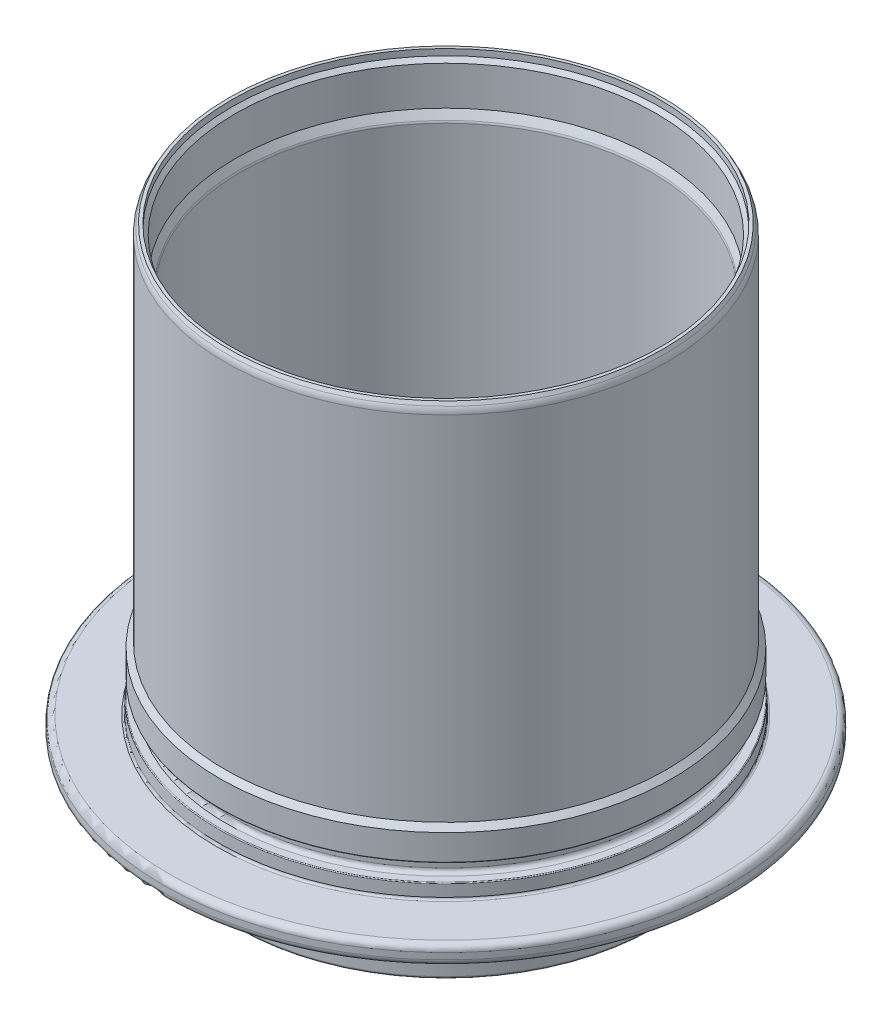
ISO-10303-21;
HEADER;
FILE_DESCRIPTION(('STEP AP214'),'2;1');
FILE_NAME('part.step','',(''),(''),'','','');
FILE_SCHEMA(('AUTOMOTIVE_DESIGN { 1 0 10303 214 1 1 1 1 }'));
ENDSEC;
DATA;
#1=APPLICATION_CONTEXT('core data for automotive mechanical design processes');
#2=APPLICATION_PROTOCOL_DEFINITION('international standard','automotive_design',2000,#1);
#3=PRODUCT_CONTEXT('',#1,'mechanical');
#4=PRODUCT('Part','Part','',(#3));
#5=PRODUCT_RELATED_PRODUCT_CATEGORY('part','',(#4));
#6=PRODUCT_DEFINITION_FORMATION('','',#4);
#7=PRODUCT_DEFINITION_CONTEXT('part definition',#1,'design');
#8=PRODUCT_DEFINITION('design','',#6,#7);
#9=PRODUCT_DEFINITION_SHAPE('','',#8);
#10=(LENGTH_UNIT() NAMED_UNIT(*) SI_UNIT(.MILLI.,.METRE.));
#11=(NAMED_UNIT(*) PLANE_ANGLE_UNIT() SI_UNIT($,.RADIAN.));
#12=(NAMED_UNIT(*) SI_UNIT($,.STERADIAN.) SOLID_ANGLE_UNIT());
#13=UNCERTAINTY_MEASURE_WITH_UNIT(LENGTH_MEASURE(1.E-05),#10,'distance_accuracy_value','');
#14=(GEOMETRIC_REPRESENTATION_CONTEXT(3) GLOBAL_UNCERTAINTY_ASSIGNED_CONTEXT((#13)) GLOBAL_UNIT_ASSIGNED_CONTEXT((#10,
#11,#12)) REPRESENTATION_CONTEXT('',''));
#15=CARTESIAN_POINT('',(0.,0.,0.));
#16=DIRECTION('',(0.,0.,1.));
#17=DIRECTION('',(1.,0.,0.));
#18=AXIS2_PLACEMENT_3D('',#15,#16,#17);
#19=CARTESIAN_POINT('',(-71.1716849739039,54.6294667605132,0.));
#20=DIRECTION('',(0.,1.,0.));
#21=DIRECTION('',(-1.,0.,0.));
#22=AXIS2_PLACEMENT_3D('',#19,#20,#21);
#23=TOROIDAL_SURFACE('',#22,37.0850000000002,11.9999999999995);
#24=CARTESIAN_POINT('',(-71.1716849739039,54.6294667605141,0.));
#25=DIRECTION('',(0.,1.,0.));
#26=DIRECTION('',(-1.,0.,0.));
#27=AXIS2_PLACEMENT_3D('',#24,#25,#26);
#28=CIRCLE('',#27,49.085);
#29=CARTESIAN_POINT('',(-120.256684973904,54.629466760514,0.));
#30=VERTEX_POINT('',#29);
#31=EDGE_CURVE('E189',#30,#30,#28,.T.);
#32=ORIENTED_EDGE('',*,*,#31,.T.);
#33=EDGE_LOOP('',(#32));
#34=FACE_BOUND('',#33,.T.);
#35=CARTESIAN_POINT('',(-71.1716849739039,46.1441853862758,0.));
#36=DIRECTION('',(0.,1.,0.));
#37=DIRECTION('',(-1.,0.,0.));
#38=AXIS2_PLACEMENT_3D('',#35,#36,#37);
#39=CIRCLE('',#38,45.5702813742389);
#40=CARTESIAN_POINT('',(-116.741966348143,46.1441853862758,0.));
#41=VERTEX_POINT('',#40);
#42=EDGE_CURVE('E10',#41,#41,#39,.T.);
#43=ORIENTED_EDGE('',*,*,#42,.F.);
#44=EDGE_LOOP('',(#43));
#45=FACE_BOUND('',#44,.T.);
#46=ADVANCED_FACE('F35',(#34,#45),#23,.F.);
#47=CARTESIAN_POINT('',(-71.1716849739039,40.4667972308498,0.));
#48=DIRECTION('',(0.,1.,0.));
#49=DIRECTION('',(-1.,0.,0.));
#50=AXIS2_PLACEMENT_3D('',#47,#48,#49);
#51=CONICAL_SURFACE('',#50,39.8928932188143,0.785398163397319);
#52=ORIENTED_EDGE('',*,*,#42,.T.);
#53=EDGE_LOOP('',(#52));
#54=FACE_BOUND('',#53,.T.);
#55=CARTESIAN_POINT('',(-71.1716849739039,40.4667972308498,0.));
#56=DIRECTION('',(0.,1.,0.));
#57=DIRECTION('',(-1.,0.,0.));
#58=AXIS2_PLACEMENT_3D('',#55,#56,#57);
#59=CIRCLE('',#58,39.8928932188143);
#60=CARTESIAN_POINT('',(-111.064578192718,40.4667972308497,0.));
#61=VERTEX_POINT('',#60);
#62=EDGE_CURVE('E41',#61,#61,#59,.T.);
#63=ORIENTED_EDGE('',*,*,#62,.F.);
#64=EDGE_LOOP('',(#63));
#65=FACE_BOUND('',#64,.T.);
#66=ADVANCED_FACE('F207',(#54,#65),#51,.F.);
#67=CARTESIAN_POINT('',(-71.1716849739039,39.7596904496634,0.));
#68=DIRECTION('',(0.,1.,0.));
#69=DIRECTION('',(-1.,0.,0.));
#70=AXIS2_PLACEMENT_3D('',#67,#68,#69);
#71=TOROIDAL_SURFACE('',#70,40.6000000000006,1.00000000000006);
#72=ORIENTED_EDGE('',*,*,#62,.T.);
#73=EDGE_LOOP('',(#72));
#74=FACE_BOUND('',#73,.T.);
#75=CARTESIAN_POINT('',(-71.1716849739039,39.7596904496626,0.));
#76=DIRECTION('',(0.,1.,0.));
#77=DIRECTION('',(-1.,0.,0.));
#78=AXIS2_PLACEMENT_3D('',#75,#76,#77);
#79=CIRCLE('',#78,39.6000000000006);
#80=CARTESIAN_POINT('',(-110.771684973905,39.7596904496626,0.));
#81=VERTEX_POINT('',#80);
#82=EDGE_CURVE('E45',#81,#81,#79,.T.);
#83=ORIENTED_EDGE('',*,*,#82,.F.);
#84=EDGE_LOOP('',(#83));
#85=FACE_BOUND('',#84,.T.);
#86=ADVANCED_FACE('F211',(#74,#85),#71,.T.);
#87=CARTESIAN_POINT('',(-71.1716849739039,158.736724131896,0.));
#88=DIRECTION('',(0.,1.,0.));
#89=DIRECTION('',(-1.,0.,0.));
#90=AXIS2_PLACEMENT_3D('',#87,#88,#89);
#91=CYLINDRICAL_SURFACE('',#90,39.6000000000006);
#92=ORIENTED_EDGE('',*,*,#82,.T.);
#93=EDGE_LOOP('',(#92));
#94=FACE_BOUND('',#93,.T.);
#95=CARTESIAN_POINT('',(-71.1716849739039,39.2739577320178,0.));
#96=DIRECTION('',(0.,1.,0.));
#97=DIRECTION('',(-1.,0.,0.));
#98=AXIS2_PLACEMENT_3D('',#95,#96,#97);
#99=CIRCLE('',#98,39.6000000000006);
#100=CARTESIAN_POINT('',(-110.771684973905,39.2739577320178,0.));
#101=VERTEX_POINT('',#100);
#102=EDGE_CURVE('E49',#101,#101,#99,.T.);
#103=ORIENTED_EDGE('',*,*,#102,.F.);
#104=EDGE_LOOP('',(#103));
#105=FACE_BOUND('',#104,.T.);
#106=ADVANCED_FACE('F215',(#94,#105),#91,.F.);
#107=CARTESIAN_POINT('',(-71.1716849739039,39.2739577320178,0.));
#108=DIRECTION('',(0.,1.,0.));
#109=DIRECTION('',(-1.,0.,0.));
#110=AXIS2_PLACEMENT_3D('',#107,#108,#109);
#111=TOROIDAL_SURFACE('',#110,40.0000000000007,0.400000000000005);
#112=ORIENTED_EDGE('',*,*,#102,.T.);
#113=EDGE_LOOP('',(#112));
#114=FACE_BOUND('',#113,.T.);
#115=CARTESIAN_POINT('',(-71.1716849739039,38.8739577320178,0.));
#116=DIRECTION('',(0.,1.,0.));
#117=DIRECTION('',(-1.,0.,0.));
#118=AXIS2_PLACEMENT_3D('',#115,#116,#117);
#119=CIRCLE('',#118,40.0000000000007);
#120=CARTESIAN_POINT('',(-111.171684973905,38.8739577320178,0.));
#121=VERTEX_POINT('',#120);
#122=EDGE_CURVE('E54',#121,#121,#119,.T.);
#123=ORIENTED_EDGE('',*,*,#122,.F.);
#124=EDGE_LOOP('',(#123));
#125=FACE_BOUND('',#124,.T.);
#126=ADVANCED_FACE('F221',(#114,#125),#111,.T.);
#127=CARTESIAN_POINT('',(-113.496714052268,38.8739577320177,0.));
#128=DIRECTION('',(0.,-1.,0.));
#129=DIRECTION('',(1.,0.,0.));
#130=AXIS2_PLACEMENT_3D('',#127,#128,#129);
#131=PLANE('',#130);
#132=ORIENTED_EDGE('',*,*,#122,.T.);
#133=EDGE_LOOP('',(#132));
#134=FACE_BOUND('',#133,.T.);
#135=CARTESIAN_POINT('',(-71.1716849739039,38.8739577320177,0.));
#136=DIRECTION('',(0.,1.,0.));
#137=DIRECTION('',(-1.,0.,0.));
#138=AXIS2_PLACEMENT_3D('',#135,#136,#137);
#139=CIRCLE('',#138,42.3250290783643);
#140=CARTESIAN_POINT('',(-113.496714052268,38.8739577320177,0.));
#141=VERTEX_POINT('',#140);
#142=EDGE_CURVE('E57',#141,#141,#139,.T.);
#143=ORIENTED_EDGE('',*,*,#142,.F.);
#144=EDGE_LOOP('',(#143));
#145=FACE_BOUND('',#144,.T.);
#146=ADVANCED_FACE('F225',(#134,#145),#131,.T.);
#147=CARTESIAN_POINT('',(-71.1716849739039,37.3739577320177,0.));
#148=DIRECTION('',(0.,1.,0.));
#149=DIRECTION('',(-1.,0.,0.));
#150=AXIS2_PLACEMENT_3D('',#147,#148,#149);
#151=TOROIDAL_SURFACE('',#150,42.3250290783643,1.5);
#152=ORIENTED_EDGE('',*,*,#142,.T.);
#153=EDGE_LOOP('',(#152));
#154=FACE_BOUND('',#153,.T.);
#155=CARTESIAN_POINT('',(-71.1716849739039,37.3739577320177,0.));
#156=DIRECTION('',(0.,1.,0.));
#157=DIRECTION('',(-1.,0.,0.));
#158=AXIS2_PLACEMENT_3D('',#155,#156,#157);
#159=CIRCLE('',#158,43.8250290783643);
#160=CARTESIAN_POINT('',(-114.996714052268,37.3739577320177,0.));
#161=VERTEX_POINT('',#160);
#162=EDGE_CURVE('E60',#161,#161,#159,.T.);
#163=ORIENTED_EDGE('',*,*,#162,.F.);
#164=EDGE_LOOP('',(#163));
#165=FACE_BOUND('',#164,.T.);
#166=ADVANCED_FACE('F229',(#154,#165),#151,.F.);
#167=CARTESIAN_POINT('',(-71.1716849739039,158.736724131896,0.));
#168=DIRECTION('',(0.,1.,0.));
#169=DIRECTION('',(-1.,0.,0.));
#170=AXIS2_PLACEMENT_3D('',#167,#168,#169);
#171=CYLINDRICAL_SURFACE('',#170,43.8250290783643);
#172=ORIENTED_EDGE('',*,*,#162,.T.);
#173=EDGE_LOOP('',(#172));
#174=FACE_BOUND('',#173,.T.);
#175=CARTESIAN_POINT('',(-71.1716849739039,34.3739577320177,0.));
#176=DIRECTION('',(0.,1.,0.));
#177=DIRECTION('',(-1.,0.,0.));
#178=AXIS2_PLACEMENT_3D('',#175,#176,#177);
#179=CIRCLE('',#178,43.8250290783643);
#180=CARTESIAN_POINT('',(-114.996714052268,34.3739577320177,0.));
#181=VERTEX_POINT('',#180);
#182=EDGE_CURVE('E63',#181,#181,#179,.T.);
#183=ORIENTED_EDGE('',*,*,#182,.F.);
#184=EDGE_LOOP('',(#183));
#185=FACE_BOUND('',#184,.T.);
#186=ADVANCED_FACE('F233',(#174,#185),#171,.F.);
#187=CARTESIAN_POINT('',(-71.1716849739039,34.3739577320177,0.));
#188=DIRECTION('',(0.,1.,0.));
#189=DIRECTION('',(-1.,0.,0.));
#190=AXIS2_PLACEMENT_3D('',#187,#188,#189);
#191=TOROIDAL_SURFACE('',#190,42.3250290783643,1.5);
#192=ORIENTED_EDGE('',*,*,#182,.T.);
#193=EDGE_LOOP('',(#192));
#194=FACE_BOUND('',#193,.T.);
#195=CARTESIAN_POINT('',(-71.1716849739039,32.8739577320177,0.));
#196=DIRECTION('',(0.,1.,0.));
#197=DIRECTION('',(-1.,0.,0.));
#198=AXIS2_PLACEMENT_3D('',#195,#196,#197);
#199=CIRCLE('',#198,42.3250290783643);
#200=CARTESIAN_POINT('',(-113.496714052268,32.8739577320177,0.));
#201=VERTEX_POINT('',#200);
#202=EDGE_CURVE('E66',#201,#201,#199,.T.);
#203=ORIENTED_EDGE('',*,*,#202,.F.);
#204=EDGE_LOOP('',(#203));
#205=FACE_BOUND('',#204,.T.);
#206=ADVANCED_FACE('F237',(#194,#205),#191,.F.);
#207=CARTESIAN_POINT('',(-113.496714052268,32.8739577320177,0.));
#208=DIRECTION('',(0.,1.,0.));
#209=DIRECTION('',(-1.,0.,0.));
#210=AXIS2_PLACEMENT_3D('',#207,#208,#209);
#211=PLANE('',#210);
#212=ORIENTED_EDGE('',*,*,#202,.T.);
#213=EDGE_LOOP('',(#212));
#214=FACE_BOUND('',#213,.T.);
#215=CARTESIAN_POINT('',(-71.1716849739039,32.8739577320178,0.));
#216=DIRECTION('',(0.,1.,0.));
#217=DIRECTION('',(-1.,0.,0.));
#218=AXIS2_PLACEMENT_3D('',#215,#216,#217);
#219=CIRCLE('',#218,39.3500000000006);
#220=CARTESIAN_POINT('',(-110.521684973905,32.8739577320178,0.));
#221=VERTEX_POINT('',#220);
#222=EDGE_CURVE('E69',#221,#221,#219,.T.);
#223=ORIENTED_EDGE('',*,*,#222,.F.);
#224=EDGE_LOOP('',(#223));
#225=FACE_BOUND('',#224,.T.);
#226=ADVANCED_FACE('F241',(#214,#225),#211,.T.);
#227=CARTESIAN_POINT('',(-71.1716849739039,32.4739577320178,0.));
#228=DIRECTION('',(0.,1.,0.));
#229=DIRECTION('',(-1.,0.,0.));
#230=AXIS2_PLACEMENT_3D('',#227,#228,#229);
#231=TOROIDAL_SURFACE('',#230,39.3500000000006,0.399999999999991);
#232=ORIENTED_EDGE('',*,*,#222,.T.);
#233=EDGE_LOOP('',(#232));
#234=FACE_BOUND('',#233,.T.);
#235=CARTESIAN_POINT('',(-71.1716849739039,32.4739577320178,0.));
#236=DIRECTION('',(0.,1.,0.));
#237=DIRECTION('',(-1.,0.,0.));
#238=AXIS2_PLACEMENT_3D('',#235,#236,#237);
#239=CIRCLE('',#238,38.9500000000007);
#240=CARTESIAN_POINT('',(-110.121684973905,32.4739577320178,0.));
#241=VERTEX_POINT('',#240);
#242=EDGE_CURVE('E72',#241,#241,#239,.T.);
#243=ORIENTED_EDGE('',*,*,#242,.F.);
#244=EDGE_LOOP('',(#243));
#245=FACE_BOUND('',#244,.T.);
#246=ADVANCED_FACE('F245',(#234,#245),#231,.T.);
#247=CARTESIAN_POINT('',(-71.1716849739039,158.736724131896,0.));
#248=DIRECTION('',(0.,1.,0.));
#249=DIRECTION('',(-1.,0.,0.));
#250=AXIS2_PLACEMENT_3D('',#247,#248,#249);
#251=CYLINDRICAL_SURFACE('',#250,38.9500000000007);
#252=ORIENTED_EDGE('',*,*,#242,.T.);
#253=EDGE_LOOP('',(#252));
#254=FACE_BOUND('',#253,.T.);
#255=CARTESIAN_POINT('',(-71.1716849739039,31.6419486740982,0.));
#256=DIRECTION('',(0.,1.,0.));
#257=DIRECTION('',(-1.,0.,0.));
#258=AXIS2_PLACEMENT_3D('',#255,#256,#257);
#259=CIRCLE('',#258,38.9500000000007);
#260=CARTESIAN_POINT('',(-110.121684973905,31.6419486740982,0.));
#261=VERTEX_POINT('',#260);
#262=EDGE_CURVE('E75',#261,#261,#259,.T.);
#263=ORIENTED_EDGE('',*,*,#262,.F.);
#264=EDGE_LOOP('',(#263));
#265=FACE_BOUND('',#264,.T.);
#266=ADVANCED_FACE('F249',(#254,#265),#251,.F.);
#267=CARTESIAN_POINT('',(-71.1716849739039,31.6419486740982,0.));
#268=DIRECTION('',(0.,1.,0.));
#269=DIRECTION('',(-1.,0.,0.));
#270=AXIS2_PLACEMENT_3D('',#267,#268,#269);
#271=TOROIDAL_SURFACE('',#270,39.9500000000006,1.00000000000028);
#272=ORIENTED_EDGE('',*,*,#262,.T.);
#273=EDGE_LOOP('',(#272));
#274=FACE_BOUND('',#273,.T.);
#275=CARTESIAN_POINT('',(-71.1716849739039,31.1419486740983,0.));
#276=DIRECTION('',(0.,1.,0.));
#277=DIRECTION('',(-1.,0.,0.));
#278=AXIS2_PLACEMENT_3D('',#275,#276,#277);
#279=CIRCLE('',#278,39.0839745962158);
#280=CARTESIAN_POINT('',(-110.25565957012,31.1419486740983,0.));
#281=VERTEX_POINT('',#280);
#282=EDGE_CURVE('E78',#281,#281,#279,.T.);
#283=ORIENTED_EDGE('',*,*,#282,.F.);
#284=EDGE_LOOP('',(#283));
#285=FACE_BOUND('',#284,.T.);
#286=ADVANCED_FACE('F253',(#274,#285),#271,.T.);
#287=CARTESIAN_POINT('',(-71.1716849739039,30.3739577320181,0.));
#288=DIRECTION('',(0.,-1.,0.));
#289=DIRECTION('',(1.,0.,0.));
#290=AXIS2_PLACEMENT_3D('',#287,#288,#289);
#291=CONICAL_SURFACE('',#290,39.5273743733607,0.523598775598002);
#292=ORIENTED_EDGE('',*,*,#282,.T.);
#293=EDGE_LOOP('',(#292));
#294=FACE_BOUND('',#293,.T.);
#295=CARTESIAN_POINT('',(-71.1716849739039,30.3739577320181,0.));
#296=DIRECTION('',(0.,1.,0.));
#297=DIRECTION('',(-1.,0.,0.));
#298=AXIS2_PLACEMENT_3D('',#295,#296,#297);
#299=CIRCLE('',#298,39.5273743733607);
#300=CARTESIAN_POINT('',(-110.699059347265,30.3739577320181,0.));
#301=VERTEX_POINT('',#300);
#302=EDGE_CURVE('E81',#301,#301,#299,.T.);
#303=ORIENTED_EDGE('',*,*,#302,.F.);
#304=EDGE_LOOP('',(#303));
#305=FACE_BOUND('',#304,.T.);
#306=ADVANCED_FACE('F257',(#294,#305),#291,.F.);
#307=CARTESIAN_POINT('',(-110.699059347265,30.3739577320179,0.));
#308=DIRECTION('',(0.,-1.,0.));
#309=DIRECTION('',(1.,0.,0.));
#310=AXIS2_PLACEMENT_3D('',#307,#308,#309);
#311=PLANE('',#310);
#312=ORIENTED_EDGE('',*,*,#302,.T.);
#313=EDGE_LOOP('',(#312));
#314=FACE_BOUND('',#313,.T.);
#315=CARTESIAN_POINT('',(-71.1716849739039,30.3739577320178,0.));
#316=DIRECTION('',(0.,1.,0.));
#317=DIRECTION('',(-1.,0.,0.));
#318=AXIS2_PLACEMENT_3D('',#315,#316,#317);
#319=CIRCLE('',#318,49.3000000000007);
#320=CARTESIAN_POINT('',(-120.471684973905,30.3739577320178,0.));
#321=VERTEX_POINT('',#320);
#322=EDGE_CURVE('E84',#321,#321,#319,.T.);
#323=ORIENTED_EDGE('',*,*,#322,.F.);
#324=EDGE_LOOP('',(#323));
#325=FACE_BOUND('',#324,.T.);
#326=ADVANCED_FACE('F261',(#314,#325),#311,.T.);
#327=CARTESIAN_POINT('',(-71.1716849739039,30.8739577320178,0.));
#328=DIRECTION('',(0.,1.,0.));
#329=DIRECTION('',(-1.,0.,0.));
#330=AXIS2_PLACEMENT_3D('',#327,#328,#329);
#331=TOROIDAL_SURFACE('',#330,49.3000000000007,0.500000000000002);
#332=ORIENTED_EDGE('',*,*,#322,.T.);
#333=EDGE_LOOP('',(#332));
#334=FACE_BOUND('',#333,.T.);
#335=CARTESIAN_POINT('',(-71.1716849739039,30.8739577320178,0.));
#336=DIRECTION('',(0.,1.,0.));
#337=DIRECTION('',(-1.,0.,0.));
#338=AXIS2_PLACEMENT_3D('',#335,#336,#337);
#339=CIRCLE('',#338,49.8000000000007);
#340=CARTESIAN_POINT('',(-120.971684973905,30.8739577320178,0.));
#341=VERTEX_POINT('',#340);
#342=EDGE_CURVE('E87',#341,#341,#339,.T.);
#343=ORIENTED_EDGE('',*,*,#342,.F.);
#344=EDGE_LOOP('',(#343));
#345=FACE_BOUND('',#344,.T.);
#346=ADVANCED_FACE('F265',(#334,#345),#331,.T.);
#347=CARTESIAN_POINT('',(-71.1716849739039,158.736724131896,0.));
#348=DIRECTION('',(0.,1.,0.));
#349=DIRECTION('',(-1.,0.,0.));
#350=AXIS2_PLACEMENT_3D('',#347,#348,#349);
#351=CYLINDRICAL_SURFACE('',#350,49.8000000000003);
#352=ORIENTED_EDGE('',*,*,#342,.T.);
#353=EDGE_LOOP('',(#352));
#354=FACE_BOUND('',#353,.T.);
#355=CARTESIAN_POINT('',(-71.1716849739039,34.5858430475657,0.));
#356=DIRECTION('',(0.,1.,0.));
#357=DIRECTION('',(-1.,0.,0.));
#358=AXIS2_PLACEMENT_3D('',#355,#356,#357);
#359=CIRCLE('',#358,49.8);
#360=CARTESIAN_POINT('',(-120.971684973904,34.5858430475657,0.));
#361=VERTEX_POINT('',#360);
#362=EDGE_CURVE('E90',#361,#361,#359,.T.);
#363=ORIENTED_EDGE('',*,*,#362,.F.);
#364=EDGE_LOOP('',(#363));
#365=FACE_BOUND('',#364,.T.);
#366=ADVANCED_FACE('F269',(#354,#365),#351,.T.);
#367=CARTESIAN_POINT('',(-71.1716849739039,34.5858430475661,0.));
#368=DIRECTION('',(0.,1.,0.));
#369=DIRECTION('',(-1.,0.,0.));
#370=AXIS2_PLACEMENT_3D('',#367,#368,#369);
#371=TOROIDAL_SURFACE('',#370,48.3000000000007,1.49999999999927);
#372=ORIENTED_EDGE('',*,*,#362,.T.);
#373=EDGE_LOOP('',(#372));
#374=FACE_BOUND('',#373,.T.);
#375=CARTESIAN_POINT('',(-71.1716849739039,35.3358430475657,0.));
#376=DIRECTION('',(0.,1.,0.));
#377=DIRECTION('',(-1.,0.,0.));
#378=AXIS2_PLACEMENT_3D('',#375,#376,#377);
#379=CIRCLE('',#378,49.5990381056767);
#380=CARTESIAN_POINT('',(-120.770723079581,35.3358430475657,0.));
#381=VERTEX_POINT('',#380);
#382=EDGE_CURVE('E93',#381,#381,#379,.T.);
#383=ORIENTED_EDGE('',*,*,#382,.F.);
#384=EDGE_LOOP('',(#383));
#385=FACE_BOUND('',#384,.T.);
#386=ADVANCED_FACE('F273',(#374,#385),#371,.T.);
#387=CARTESIAN_POINT('',(-71.1716849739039,37.93058715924,0.));
#388=DIRECTION('',(0.,-1.,0.));
#389=DIRECTION('',(1.,0.,0.));
#390=AXIS2_PLACEMENT_3D('',#387,#388,#389);
#391=CONICAL_SURFACE('',#390,48.1009618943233,0.523598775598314);
#392=ORIENTED_EDGE('',*,*,#382,.T.);
#393=EDGE_LOOP('',(#392));
#394=FACE_BOUND('',#393,.T.);
#395=CARTESIAN_POINT('',(-71.1716849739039,37.93058715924,0.));
#396=DIRECTION('',(0.,1.,0.));
#397=DIRECTION('',(-1.,0.,0.));
#398=AXIS2_PLACEMENT_3D('',#395,#396,#397);
#399=CIRCLE('',#398,48.1009618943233);
#400=CARTESIAN_POINT('',(-119.272646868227,37.93058715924,0.));
#401=VERTEX_POINT('',#400);
#402=EDGE_CURVE('E96',#401,#401,#399,.T.);
#403=ORIENTED_EDGE('',*,*,#402,.F.);
#404=EDGE_LOOP('',(#403));
#405=FACE_BOUND('',#404,.T.);
#406=ADVANCED_FACE('F277',(#394,#405),#391,.T.);
#407=CARTESIAN_POINT('',(-71.1716849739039,38.6805871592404,0.));
#408=DIRECTION('',(0.,1.,0.));
#409=DIRECTION('',(-1.,0.,0.));
#410=AXIS2_PLACEMENT_3D('',#407,#408,#409);
#411=TOROIDAL_SURFACE('',#410,49.4000000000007,1.50000000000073);
#412=ORIENTED_EDGE('',*,*,#402,.T.);
#413=EDGE_LOOP('',(#412));
#414=FACE_BOUND('',#413,.T.);
#415=CARTESIAN_POINT('',(-71.1716849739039,38.68058715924,0.));
#416=DIRECTION('',(0.,1.,0.));
#417=DIRECTION('',(-1.,0.,0.));
#418=AXIS2_PLACEMENT_3D('',#415,#416,#417);
#419=CIRCLE('',#418,47.8999999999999);
#420=CARTESIAN_POINT('',(-119.071684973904,38.6805871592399,0.));
#421=VERTEX_POINT('',#420);
#422=EDGE_CURVE('E99',#421,#421,#419,.T.);
#423=ORIENTED_EDGE('',*,*,#422,.F.);
#424=EDGE_LOOP('',(#423));
#425=FACE_BOUND('',#424,.T.);
#426=ADVANCED_FACE('F281',(#414,#425),#411,.F.);
#427=CARTESIAN_POINT('',(-71.1716849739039,158.736724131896,0.));
#428=DIRECTION('',(0.,1.,0.));
#429=DIRECTION('',(-1.,0.,0.));
#430=AXIS2_PLACEMENT_3D('',#427,#428,#429);
#431=CYLINDRICAL_SURFACE('',#430,47.9);
#432=ORIENTED_EDGE('',*,*,#422,.T.);
#433=EDGE_LOOP('',(#432));
#434=FACE_BOUND('',#433,.T.);
#435=CARTESIAN_POINT('',(-71.1716849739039,40.8767395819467,0.));
#436=DIRECTION('',(0.,1.,0.));
#437=DIRECTION('',(-1.,0.,0.));
#438=AXIS2_PLACEMENT_3D('',#435,#436,#437);
#439=CIRCLE('',#438,47.9000000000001);
#440=CARTESIAN_POINT('',(-119.071684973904,40.8767395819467,0.));
#441=VERTEX_POINT('',#440);
#442=EDGE_CURVE('E102',#441,#441,#439,.T.);
#443=ORIENTED_EDGE('',*,*,#442,.F.);
#444=EDGE_LOOP('',(#443));
#445=FACE_BOUND('',#444,.T.);
#446=ADVANCED_FACE('F285',(#434,#445),#431,.T.);
#447=CARTESIAN_POINT('',(-71.1716849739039,40.876739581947,0.));
#448=DIRECTION('',(0.,1.,0.));
#449=DIRECTION('',(-1.,0.,0.));
#450=AXIS2_PLACEMENT_3D('',#447,#448,#449);
#451=TOROIDAL_SURFACE('',#450,49.4000000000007,1.50000000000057);
#452=ORIENTED_EDGE('',*,*,#442,.T.);
#453=EDGE_LOOP('',(#452));
#454=FACE_BOUND('',#453,.T.);
#455=CARTESIAN_POINT('',(-71.1716849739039,41.626739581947,0.));
#456=DIRECTION('',(0.,1.,0.));
#457=DIRECTION('',(-1.,0.,0.));
#458=AXIS2_PLACEMENT_3D('',#455,#456,#457);
#459=CIRCLE('',#458,48.1009618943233);
#460=CARTESIAN_POINT('',(-119.272646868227,41.626739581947,0.));
#461=VERTEX_POINT('',#460);
#462=EDGE_CURVE('E105',#461,#461,#459,.T.);
#463=ORIENTED_EDGE('',*,*,#462,.F.);
#464=EDGE_LOOP('',(#463));
#465=FACE_BOUND('',#464,.T.);
#466=ADVANCED_FACE('F289',(#454,#465),#451,.F.);
#467=CARTESIAN_POINT('',(-71.1716849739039,44.6239577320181,0.));
#468=DIRECTION('',(0.,1.,0.));
#469=DIRECTION('',(-1.,0.,0.));
#470=AXIS2_PLACEMENT_3D('',#467,#468,#469);
#471=CONICAL_SURFACE('',#470,49.8314066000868,0.52359877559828);
#472=ORIENTED_EDGE('',*,*,#462,.T.);
#473=EDGE_LOOP('',(#472));
#474=FACE_BOUND('',#473,.T.);
#475=CARTESIAN_POINT('',(-71.1716849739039,44.6239577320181,0.));
#476=DIRECTION('',(0.,1.,0.));
#477=DIRECTION('',(-1.,0.,0.));
#478=AXIS2_PLACEMENT_3D('',#475,#476,#477);
#479=CIRCLE('',#478,49.8314066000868);
#480=CARTESIAN_POINT('',(-121.003091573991,44.6239577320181,0.));
#481=VERTEX_POINT('',#480);
#482=EDGE_CURVE('E108',#481,#481,#479,.T.);
#483=ORIENTED_EDGE('',*,*,#482,.F.);
#484=EDGE_LOOP('',(#483));
#485=FACE_BOUND('',#484,.T.);
#486=ADVANCED_FACE('F293',(#474,#485),#471,.T.);
#487=CARTESIAN_POINT('',(-71.1716849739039,43.8739577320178,0.));
#488=DIRECTION('',(0.,1.,0.));
#489=DIRECTION('',(-1.,0.,0.));
#490=AXIS2_PLACEMENT_3D('',#487,#488,#489);
#491=TOROIDAL_SURFACE('',#490,51.130444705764,1.50000000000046);
#492=ORIENTED_EDGE('',*,*,#482,.T.);
#493=EDGE_LOOP('',(#492));
#494=FACE_BOUND('',#493,.T.);
#495=CARTESIAN_POINT('',(-71.1716849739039,45.3739577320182,0.));
#496=DIRECTION('',(0.,1.,0.));
#497=DIRECTION('',(-1.,0.,0.));
#498=AXIS2_PLACEMENT_3D('',#495,#496,#497);
#499=CIRCLE('',#498,51.1304447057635);
#500=CARTESIAN_POINT('',(-122.302129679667,45.3739577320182,0.));
#501=VERTEX_POINT('',#500);
#502=EDGE_CURVE('E111',#501,#501,#499,.T.);
#503=ORIENTED_EDGE('',*,*,#502,.F.);
#504=EDGE_LOOP('',(#503));
#505=FACE_BOUND('',#504,.T.);
#506=ADVANCED_FACE('F297',(#494,#505),#491,.F.);
#507=CARTESIAN_POINT('',(-137.171684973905,45.373957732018,0.));
#508=DIRECTION('',(0.,-1.,0.));
#509=DIRECTION('',(1.,0.,0.));
#510=AXIS2_PLACEMENT_3D('',#507,#508,#509);
#511=PLANE('',#510);
#512=ORIENTED_EDGE('',*,*,#502,.T.);
#513=EDGE_LOOP('',(#512));
#514=FACE_BOUND('',#513,.T.);
#515=CARTESIAN_POINT('',(-71.1716849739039,45.3739577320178,0.));
#516=DIRECTION('',(0.,1.,0.));
#517=DIRECTION('',(-1.,0.,0.));
#518=AXIS2_PLACEMENT_3D('',#515,#516,#517);
#519=CIRCLE('',#518,66.0000000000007);
#520=CARTESIAN_POINT('',(-137.171684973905,45.3739577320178,0.));
#521=VERTEX_POINT('',#520);
#522=EDGE_CURVE('E114',#521,#521,#519,.T.);
#523=ORIENTED_EDGE('',*,*,#522,.F.);
#524=EDGE_LOOP('',(#523));
#525=FACE_BOUND('',#524,.T.);
#526=ADVANCED_FACE('F301',(#514,#525),#511,.T.);
#527=CARTESIAN_POINT('',(-71.1716849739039,46.8739577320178,0.));
#528=DIRECTION('',(0.,1.,0.));
#529=DIRECTION('',(-1.,0.,0.));
#530=AXIS2_PLACEMENT_3D('',#527,#528,#529);
#531=TOROIDAL_SURFACE('',#530,66.0000000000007,1.5);
#532=ORIENTED_EDGE('',*,*,#522,.T.);
#533=EDGE_LOOP('',(#532));
#534=FACE_BOUND('',#533,.T.);
#535=CARTESIAN_POINT('',(-71.1716849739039,46.8739577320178,0.));
#536=DIRECTION('',(0.,1.,0.));
#537=DIRECTION('',(-1.,0.,0.));
#538=AXIS2_PLACEMENT_3D('',#535,#536,#537);
#539=CIRCLE('',#538,67.5000000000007);
#540=CARTESIAN_POINT('',(-138.671684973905,46.8739577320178,0.));
#541=VERTEX_POINT('',#540);
#542=EDGE_CURVE('E117',#541,#541,#539,.T.);
#543=ORIENTED_EDGE('',*,*,#542,.F.);
#544=EDGE_LOOP('',(#543));
#545=FACE_BOUND('',#544,.T.);
#546=ADVANCED_FACE('F305',(#534,#545),#531,.T.);
#547=CARTESIAN_POINT('',(-71.1716849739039,158.736724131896,0.));
#548=DIRECTION('',(0.,1.,0.));
#549=DIRECTION('',(-1.,0.,0.));
#550=AXIS2_PLACEMENT_3D('',#547,#548,#549);
#551=CYLINDRICAL_SURFACE('',#550,67.5000000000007);
#552=ORIENTED_EDGE('',*,*,#542,.T.);
#553=EDGE_LOOP('',(#552));
#554=FACE_BOUND('',#553,.T.);
#555=CARTESIAN_POINT('',(-71.1716849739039,48.3739577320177,0.));
#556=DIRECTION('',(0.,1.,0.));
#557=DIRECTION('',(-1.,0.,0.));
#558=AXIS2_PLACEMENT_3D('',#555,#556,#557);
#559=CIRCLE('',#558,67.5000000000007);
#560=CARTESIAN_POINT('',(-138.671684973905,48.3739577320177,0.));
#561=VERTEX_POINT('',#560);
#562=EDGE_CURVE('E120',#561,#561,#559,.T.);
#563=ORIENTED_EDGE('',*,*,#562,.F.);
#564=EDGE_LOOP('',(#563));
#565=FACE_BOUND('',#564,.T.);
#566=ADVANCED_FACE('F309',(#554,#565),#551,.T.);
#567=CARTESIAN_POINT('',(-71.1716849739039,48.3739577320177,0.));
#568=DIRECTION('',(0.,1.,0.));
#569=DIRECTION('',(-1.,0.,0.));
#570=AXIS2_PLACEMENT_3D('',#567,#568,#569);
#571=TOROIDAL_SURFACE('',#570,66.0000000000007,1.5);
#572=ORIENTED_EDGE('',*,*,#562,.T.);
#573=EDGE_LOOP('',(#572));
#574=FACE_BOUND('',#573,.T.);
#575=CARTESIAN_POINT('',(-71.1716849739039,49.8739577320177,0.));
#576=DIRECTION('',(0.,1.,0.));
#577=DIRECTION('',(-1.,0.,0.));
#578=AXIS2_PLACEMENT_3D('',#575,#576,#577);
#579=CIRCLE('',#578,66.0000000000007);
#580=CARTESIAN_POINT('',(-137.171684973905,49.8739577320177,0.));
#581=VERTEX_POINT('',#580);
#582=EDGE_CURVE('E123',#581,#581,#579,.T.);
#583=ORIENTED_EDGE('',*,*,#582,.F.);
#584=EDGE_LOOP('',(#583));
#585=FACE_BOUND('',#584,.T.);
#586=ADVANCED_FACE('F313',(#574,#585),#571,.T.);
#587=CARTESIAN_POINT('',(-137.171684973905,49.8739577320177,0.));
#588=DIRECTION('',(0.,1.,0.));
#589=DIRECTION('',(-1.,0.,0.));
#590=AXIS2_PLACEMENT_3D('',#587,#588,#589);
#591=PLANE('',#590);
#592=ORIENTED_EDGE('',*,*,#582,.T.);
#593=EDGE_LOOP('',(#592));
#594=FACE_BOUND('',#593,.T.);
#595=CARTESIAN_POINT('',(-71.1716849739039,49.8739577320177,0.));
#596=DIRECTION('',(0.,1.,0.));
#597=DIRECTION('',(-1.,0.,0.));
#598=AXIS2_PLACEMENT_3D('',#595,#596,#597);
#599=CIRCLE('',#598,54.7000000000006);
#600=CARTESIAN_POINT('',(-125.871684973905,49.8739577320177,0.));
#601=VERTEX_POINT('',#600);
#602=EDGE_CURVE('E126',#601,#601,#599,.T.);
#603=ORIENTED_EDGE('',*,*,#602,.F.);
#604=EDGE_LOOP('',(#603));
#605=FACE_BOUND('',#604,.T.);
#606=ADVANCED_FACE('F317',(#594,#605),#591,.T.);
#607=CARTESIAN_POINT('',(-71.1716849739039,50.3739577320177,0.));
#608=DIRECTION('',(0.,1.,0.));
#609=DIRECTION('',(-1.,0.,0.));
#610=AXIS2_PLACEMENT_3D('',#607,#608,#609);
#611=TOROIDAL_SURFACE('',#610,54.7000000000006,0.5);
#612=ORIENTED_EDGE('',*,*,#602,.T.);
#613=EDGE_LOOP('',(#612));
#614=FACE_BOUND('',#613,.T.);
#615=CARTESIAN_POINT('',(-71.1716849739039,50.3739577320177,0.));
#616=DIRECTION('',(0.,1.,0.));
#617=DIRECTION('',(-1.,0.,0.));
#618=AXIS2_PLACEMENT_3D('',#615,#616,#617);
#619=CIRCLE('',#618,54.2000000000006);
#620=CARTESIAN_POINT('',(-125.371684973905,50.3739577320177,0.));
#621=VERTEX_POINT('',#620);
#622=EDGE_CURVE('E129',#621,#621,#619,.T.);
#623=ORIENTED_EDGE('',*,*,#622,.F.);
#624=EDGE_LOOP('',(#623));
#625=FACE_BOUND('',#624,.T.);
#626=ADVANCED_FACE('F321',(#614,#625),#611,.F.);
#627=CARTESIAN_POINT('',(-71.1716849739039,158.736724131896,0.));
#628=DIRECTION('',(0.,1.,0.));
#629=DIRECTION('',(-1.,0.,0.));
#630=AXIS2_PLACEMENT_3D('',#627,#628,#629);
#631=CYLINDRICAL_SURFACE('',#630,54.2000000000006);
#632=ORIENTED_EDGE('',*,*,#622,.T.);
#633=EDGE_LOOP('',(#632));
#634=FACE_BOUND('',#633,.T.);
#635=CARTESIAN_POINT('',(-71.1716849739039,53.1739577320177,0.));
#636=DIRECTION('',(0.,1.,0.));
#637=DIRECTION('',(-1.,0.,0.));
#638=AXIS2_PLACEMENT_3D('',#635,#636,#637);
#639=CIRCLE('',#638,54.2000000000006);
#640=CARTESIAN_POINT('',(-125.371684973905,53.1739577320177,0.));
#641=VERTEX_POINT('',#640);
#642=EDGE_CURVE('E132',#641,#641,#639,.T.);
#643=ORIENTED_EDGE('',*,*,#642,.F.);
#644=EDGE_LOOP('',(#643));
#645=FACE_BOUND('',#644,.T.);
#646=ADVANCED_FACE('F325',(#634,#645),#631,.T.);
#647=CARTESIAN_POINT('',(-71.1716849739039,53.1739577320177,0.));
#648=DIRECTION('',(0.,1.,0.));
#649=DIRECTION('',(-1.,0.,0.));
#650=AXIS2_PLACEMENT_3D('',#647,#648,#649);
#651=TOROIDAL_SURFACE('',#650,54.0000000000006,0.200000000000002);
#652=ORIENTED_EDGE('',*,*,#642,.T.);
#653=EDGE_LOOP('',(#652));
#654=FACE_BOUND('',#653,.T.);
#655=CARTESIAN_POINT('',(-71.1716849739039,53.3739577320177,0.));
#656=DIRECTION('',(0.,1.,0.));
#657=DIRECTION('',(-1.,0.,0.));
#658=AXIS2_PLACEMENT_3D('',#655,#656,#657);
#659=CIRCLE('',#658,54.0000000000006);
#660=CARTESIAN_POINT('',(-125.171684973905,53.3739577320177,0.));
#661=VERTEX_POINT('',#660);
#662=EDGE_CURVE('E135',#661,#661,#659,.T.);
#663=ORIENTED_EDGE('',*,*,#662,.F.);
#664=EDGE_LOOP('',(#663));
#665=FACE_BOUND('',#664,.T.);
#666=ADVANCED_FACE('F329',(#654,#665),#651,.T.);
#667=CARTESIAN_POINT('',(-125.171684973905,53.3739577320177,0.));
#668=DIRECTION('',(0.,1.,0.));
#669=DIRECTION('',(-1.,0.,0.));
#670=AXIS2_PLACEMENT_3D('',#667,#668,#669);
#671=PLANE('',#670);
#672=ORIENTED_EDGE('',*,*,#662,.T.);
#673=EDGE_LOOP('',(#672));
#674=FACE_BOUND('',#673,.T.);
#675=CARTESIAN_POINT('',(-71.1716849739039,53.3739577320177,0.));
#676=DIRECTION('',(0.,1.,0.));
#677=DIRECTION('',(-1.,0.,0.));
#678=AXIS2_PLACEMENT_3D('',#675,#676,#677);
#679=CIRCLE('',#678,52.2500000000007);
#680=CARTESIAN_POINT('',(-123.421684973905,53.3739577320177,0.));
#681=VERTEX_POINT('',#680);
#682=EDGE_CURVE('E138',#681,#681,#679,.T.);
#683=ORIENTED_EDGE('',*,*,#682,.F.);
#684=EDGE_LOOP('',(#683));
#685=FACE_BOUND('',#684,.T.);
#686=ADVANCED_FACE('F333',(#674,#685),#671,.T.);
#687=CARTESIAN_POINT('',(-71.1716849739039,54.3739577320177,0.));
#688=DIRECTION('',(0.,1.,0.));
#689=DIRECTION('',(-1.,0.,0.));
#690=AXIS2_PLACEMENT_3D('',#687,#688,#689);
#691=TOROIDAL_SURFACE('',#690,52.2500000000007,0.999999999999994);
#692=ORIENTED_EDGE('',*,*,#682,.T.);
#693=EDGE_LOOP('',(#692));
#694=FACE_BOUND('',#693,.T.);
#695=CARTESIAN_POINT('',(-71.1716849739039,54.3739577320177,0.));
#696=DIRECTION('',(0.,1.,0.));
#697=DIRECTION('',(-1.,0.,0.));
#698=AXIS2_PLACEMENT_3D('',#695,#696,#697);
#699=CIRCLE('',#698,51.2500000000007);
#700=CARTESIAN_POINT('',(-122.421684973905,54.3739577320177,0.));
#701=VERTEX_POINT('',#700);
#702=EDGE_CURVE('E141',#701,#701,#699,.T.);
#703=ORIENTED_EDGE('',*,*,#702,.F.);
#704=EDGE_LOOP('',(#703));
#705=FACE_BOUND('',#704,.T.);
#706=ADVANCED_FACE('F337',(#694,#705),#691,.F.);
#707=CARTESIAN_POINT('',(-71.1716849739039,158.736724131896,0.));
#708=DIRECTION('',(0.,1.,0.));
#709=DIRECTION('',(-1.,0.,0.));
#710=AXIS2_PLACEMENT_3D('',#707,#708,#709);
#711=CYLINDRICAL_SURFACE('',#710,51.2500000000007);
#712=ORIENTED_EDGE('',*,*,#702,.T.);
#713=EDGE_LOOP('',(#712));
#714=FACE_BOUND('',#713,.T.);
#715=CARTESIAN_POINT('',(-71.1716849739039,56.3239577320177,0.));
#716=DIRECTION('',(0.,1.,0.));
#717=DIRECTION('',(-1.,0.,0.));
#718=AXIS2_PLACEMENT_3D('',#715,#716,#717);
#719=CIRCLE('',#718,51.2500000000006);
#720=CARTESIAN_POINT('',(-122.421684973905,56.3239577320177,0.));
#721=VERTEX_POINT('',#720);
#722=EDGE_CURVE('E144',#721,#721,#719,.T.);
#723=ORIENTED_EDGE('',*,*,#722,.F.);
#724=EDGE_LOOP('',(#723));
#725=FACE_BOUND('',#724,.T.);
#726=ADVANCED_FACE('F341',(#714,#725),#711,.T.);
#727=CARTESIAN_POINT('',(-71.1716849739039,56.3239577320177,0.));
#728=DIRECTION('',(0.,1.,0.));
#729=DIRECTION('',(-1.,0.,0.));
#730=AXIS2_PLACEMENT_3D('',#727,#728,#729);
#731=TOROIDAL_SURFACE('',#730,52.2500000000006,1.);
#732=ORIENTED_EDGE('',*,*,#722,.T.);
#733=EDGE_LOOP('',(#732));
#734=FACE_BOUND('',#733,.T.);
#735=CARTESIAN_POINT('',(-71.1716849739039,57.3239577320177,0.));
#736=DIRECTION('',(0.,1.,0.));
#737=DIRECTION('',(-1.,0.,0.));
#738=AXIS2_PLACEMENT_3D('',#735,#736,#737);
#739=CIRCLE('',#738,52.2500000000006);
#740=CARTESIAN_POINT('',(-123.421684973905,57.3239577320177,0.));
#741=VERTEX_POINT('',#740);
#742=EDGE_CURVE('E147',#741,#741,#739,.T.);
#743=ORIENTED_EDGE('',*,*,#742,.F.);
#744=EDGE_LOOP('',(#743));
#745=FACE_BOUND('',#744,.T.);
#746=ADVANCED_FACE('F345',(#734,#745),#731,.F.);
#747=CARTESIAN_POINT('',(-123.421684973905,57.3239577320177,0.));
#748=DIRECTION('',(0.,-1.,0.));
#749=DIRECTION('',(1.,0.,0.));
#750=AXIS2_PLACEMENT_3D('',#747,#748,#749);
#751=PLANE('',#750);
#752=ORIENTED_EDGE('',*,*,#742,.T.);
#753=EDGE_LOOP('',(#752));
#754=FACE_BOUND('',#753,.T.);
#755=CARTESIAN_POINT('',(-71.1716849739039,57.3239577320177,0.));
#756=DIRECTION('',(0.,1.,0.));
#757=DIRECTION('',(-1.,0.,0.));
#758=AXIS2_PLACEMENT_3D('',#755,#756,#757);
#759=CIRCLE('',#758,53.8000000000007);
#760=CARTESIAN_POINT('',(-124.971684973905,57.3239577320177,0.));
#761=VERTEX_POINT('',#760);
#762=EDGE_CURVE('E150',#761,#761,#759,.T.);
#763=ORIENTED_EDGE('',*,*,#762,.F.);
#764=EDGE_LOOP('',(#763));
#765=FACE_BOUND('',#764,.T.);
#766=ADVANCED_FACE('F349',(#754,#765),#751,.T.);
#767=CARTESIAN_POINT('',(-71.1716849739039,57.5239577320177,0.));
#768=DIRECTION('',(0.,1.,0.));
#769=DIRECTION('',(-1.,0.,0.));
#770=AXIS2_PLACEMENT_3D('',#767,#768,#769);
#771=TOROIDAL_SURFACE('',#770,53.8000000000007,0.199999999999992);
#772=ORIENTED_EDGE('',*,*,#762,.T.);
#773=EDGE_LOOP('',(#772));
#774=FACE_BOUND('',#773,.T.);
#775=CARTESIAN_POINT('',(-71.1716849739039,57.5239577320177,0.));
#776=DIRECTION('',(0.,1.,0.));
#777=DIRECTION('',(-1.,0.,0.));
#778=AXIS2_PLACEMENT_3D('',#775,#776,#777);
#779=CIRCLE('',#778,54.0000000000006);
#780=CARTESIAN_POINT('',(-125.171684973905,57.5239577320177,0.));
#781=VERTEX_POINT('',#780);
#782=EDGE_CURVE('E153',#781,#781,#779,.T.);
#783=ORIENTED_EDGE('',*,*,#782,.F.);
#784=EDGE_LOOP('',(#783));
#785=FACE_BOUND('',#784,.T.);
#786=ADVANCED_FACE('F353',(#774,#785),#771,.T.);
#787=CARTESIAN_POINT('',(-71.1716849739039,158.736724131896,0.));
#788=DIRECTION('',(0.,1.,0.));
#789=DIRECTION('',(-1.,0.,0.));
#790=AXIS2_PLACEMENT_3D('',#787,#788,#789);
#791=CYLINDRICAL_SURFACE('',#790,54.0000000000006);
#792=ORIENTED_EDGE('',*,*,#782,.T.);
#793=EDGE_LOOP('',(#792));
#794=FACE_BOUND('',#793,.T.);
#795=CARTESIAN_POINT('',(-71.1716849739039,63.6239632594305,0.));
#796=DIRECTION('',(0.,1.,0.));
#797=DIRECTION('',(-1.,0.,0.));
#798=AXIS2_PLACEMENT_3D('',#795,#796,#797);
#799=CIRCLE('',#798,54.0000000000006);
#800=CARTESIAN_POINT('',(-125.171684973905,63.6239632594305,0.));
#801=VERTEX_POINT('',#800);
#802=EDGE_CURVE('E156',#801,#801,#799,.T.);
#803=ORIENTED_EDGE('',*,*,#802,.F.);
#804=EDGE_LOOP('',(#803));
#805=FACE_BOUND('',#804,.T.);
#806=ADVANCED_FACE('F357',(#794,#805),#791,.T.);
#807=CARTESIAN_POINT('',(-71.1716849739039,64.8739577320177,0.));
#808=DIRECTION('',(0.,-1.,0.));
#809=DIRECTION('',(1.,0.,0.));
#810=AXIS2_PLACEMENT_3D('',#807,#808,#809);
#811=CONICAL_SURFACE('',#810,52.7500000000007,0.785400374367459);
#812=ORIENTED_EDGE('',*,*,#802,.T.);
#813=EDGE_LOOP('',(#812));
#814=FACE_BOUND('',#813,.T.);
#815=CARTESIAN_POINT('',(-71.1716849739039,64.8739577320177,0.));
#816=DIRECTION('',(0.,1.,0.));
#817=DIRECTION('',(-1.,0.,0.));
#818=AXIS2_PLACEMENT_3D('',#815,#816,#817);
#819=CIRCLE('',#818,52.7500000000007);
#820=CARTESIAN_POINT('',(-123.921684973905,64.8739577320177,0.));
#821=VERTEX_POINT('',#820);
#822=EDGE_CURVE('E159',#821,#821,#819,.T.);
#823=ORIENTED_EDGE('',*,*,#822,.F.);
#824=EDGE_LOOP('',(#823));
#825=FACE_BOUND('',#824,.T.);
#826=ADVANCED_FACE('F361',(#814,#825),#811,.T.);
#827=CARTESIAN_POINT('',(-71.1716849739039,158.736724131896,0.));
#828=DIRECTION('',(0.,1.,0.));
#829=DIRECTION('',(-1.,0.,0.));
#830=AXIS2_PLACEMENT_3D('',#827,#828,#829);
#831=CYLINDRICAL_SURFACE('',#830,52.7500000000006);
#832=ORIENTED_EDGE('',*,*,#822,.T.);
#833=EDGE_LOOP('',(#832));
#834=FACE_BOUND('',#833,.T.);
#835=CARTESIAN_POINT('',(-71.1716849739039,149.070090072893,0.));
#836=DIRECTION('',(0.,1.,0.));
#837=DIRECTION('',(-1.,0.,0.));
#838=AXIS2_PLACEMENT_3D('',#835,#836,#837);
#839=CIRCLE('',#838,52.7500000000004);
#840=CARTESIAN_POINT('',(-123.921684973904,149.070090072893,0.));
#841=VERTEX_POINT('',#840);
#842=EDGE_CURVE('E162',#841,#841,#839,.T.);
#843=ORIENTED_EDGE('',*,*,#842,.F.);
#844=EDGE_LOOP('',(#843));
#845=FACE_BOUND('',#844,.T.);
#846=ADVANCED_FACE('F365',(#834,#845),#831,.T.);
#847=CARTESIAN_POINT('',(-71.1716849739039,149.070090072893,0.));
#848=DIRECTION('',(0.,1.,0.));
#849=DIRECTION('',(-1.,0.,0.));
#850=AXIS2_PLACEMENT_3D('',#847,#848,#849);
#851=TOROIDAL_SURFACE('',#850,49.7500000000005,2.99999999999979);
#852=ORIENTED_EDGE('',*,*,#842,.T.);
#853=EDGE_LOOP('',(#852));
#854=FACE_BOUND('',#853,.T.);
#855=CARTESIAN_POINT('',(-71.1716849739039,150.570090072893,0.));
#856=DIRECTION('',(0.,1.,0.));
#857=DIRECTION('',(-1.,0.,0.));
#858=AXIS2_PLACEMENT_3D('',#855,#856,#857);
#859=CIRCLE('',#858,52.3480762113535);
#860=CARTESIAN_POINT('',(-123.519761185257,150.570090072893,0.));
#861=VERTEX_POINT('',#860);
#862=EDGE_CURVE('E165',#861,#861,#859,.T.);
#863=ORIENTED_EDGE('',*,*,#862,.F.);
#864=EDGE_LOOP('',(#863));
#865=FACE_BOUND('',#864,.T.);
#866=ADVANCED_FACE('F369',(#854,#865),#851,.T.);
#867=CARTESIAN_POINT('',(-71.1716849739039,151.369489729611,0.));
#868=DIRECTION('',(0.,-1.,0.));
#869=DIRECTION('',(1.,0.,0.));
#870=AXIS2_PLACEMENT_3D('',#867,#868,#869);
#871=CONICAL_SURFACE('',#870,51.8865426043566,0.523598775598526);
#872=ORIENTED_EDGE('',*,*,#862,.T.);
#873=EDGE_LOOP('',(#872));
#874=FACE_BOUND('',#873,.T.);
#875=CARTESIAN_POINT('',(-71.1716849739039,151.369489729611,0.));
#876=DIRECTION('',(0.,1.,0.));
#877=DIRECTION('',(-1.,0.,0.));
#878=AXIS2_PLACEMENT_3D('',#875,#876,#877);
#879=CIRCLE('',#878,51.8865426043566);
#880=CARTESIAN_POINT('',(-123.058227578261,151.369489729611,0.));
#881=VERTEX_POINT('',#880);
#882=EDGE_CURVE('E168',#881,#881,#879,.T.);
#883=ORIENTED_EDGE('',*,*,#882,.F.);
#884=EDGE_LOOP('',(#883));
#885=FACE_BOUND('',#884,.T.);
#886=ADVANCED_FACE('F373',(#874,#885),#871,.T.);
#887=CARTESIAN_POINT('',(-71.1716849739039,151.365678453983,0.));
#888=DIRECTION('',(0.,1.,0.));
#889=DIRECTION('',(-1.,0.,0.));
#890=AXIS2_PLACEMENT_3D('',#887,#888,#889);
#891=CONICAL_SURFACE('',#890,51.1500000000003,1.56562182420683);
#892=ORIENTED_EDGE('',*,*,#882,.T.);
#893=EDGE_LOOP('',(#892));
#894=FACE_BOUND('',#893,.T.);
#895=CARTESIAN_POINT('',(-71.1716849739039,151.365678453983,0.));
#896=DIRECTION('',(0.,1.,0.));
#897=DIRECTION('',(-1.,0.,0.));
#898=AXIS2_PLACEMENT_3D('',#895,#896,#897);
#899=CIRCLE('',#898,51.1500000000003);
#900=CARTESIAN_POINT('',(-122.321684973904,151.365678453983,0.));
#901=VERTEX_POINT('',#900);
#902=EDGE_CURVE('E171',#901,#901,#899,.T.);
#903=ORIENTED_EDGE('',*,*,#902,.F.);
#904=EDGE_LOOP('',(#903));
#905=FACE_BOUND('',#904,.T.);
#906=ADVANCED_FACE('F377',(#894,#905),#891,.F.);
#907=CARTESIAN_POINT('',(-71.1716849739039,158.736724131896,0.));
#908=DIRECTION('',(0.,1.,0.));
#909=DIRECTION('',(-1.,0.,0.));
#910=AXIS2_PLACEMENT_3D('',#907,#908,#909);
#911=CYLINDRICAL_SURFACE('',#910,51.1500000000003);
#912=ORIENTED_EDGE('',*,*,#902,.T.);
#913=EDGE_LOOP('',(#912));
#914=FACE_BOUND('',#913,.T.);
#915=CARTESIAN_POINT('',(-71.1716849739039,149.865678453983,0.));
#916=DIRECTION('',(0.,1.,0.));
#917=DIRECTION('',(-1.,0.,0.));
#918=AXIS2_PLACEMENT_3D('',#915,#916,#917);
#919=CIRCLE('',#918,51.1500000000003);
#920=CARTESIAN_POINT('',(-122.321684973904,149.865678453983,0.));
#921=VERTEX_POINT('',#920);
#922=EDGE_CURVE('E174',#921,#921,#919,.T.);
#923=ORIENTED_EDGE('',*,*,#922,.F.);
#924=EDGE_LOOP('',(#923));
#925=FACE_BOUND('',#924,.T.);
#926=ADVANCED_FACE('F381',(#914,#925),#911,.F.);
#927=CARTESIAN_POINT('',(-71.1716849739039,148.965678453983,0.));
#928=DIRECTION('',(0.,1.,0.));
#929=DIRECTION('',(-1.,0.,0.));
#930=AXIS2_PLACEMENT_3D('',#927,#928,#929);
#931=CONICAL_SURFACE('',#930,50.25,0.785398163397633);
#932=ORIENTED_EDGE('',*,*,#922,.T.);
#933=EDGE_LOOP('',(#932));
#934=FACE_BOUND('',#933,.T.);
#935=CARTESIAN_POINT('',(-71.1716849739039,148.965678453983,0.));
#936=DIRECTION('',(0.,1.,0.));
#937=DIRECTION('',(-1.,0.,0.));
#938=AXIS2_PLACEMENT_3D('',#935,#936,#937);
#939=CIRCLE('',#938,50.25);
#940=CARTESIAN_POINT('',(-121.421684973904,148.965678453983,0.));
#941=VERTEX_POINT('',#940);
#942=EDGE_CURVE('E177',#941,#941,#939,.T.);
#943=ORIENTED_EDGE('',*,*,#942,.F.);
#944=EDGE_LOOP('',(#943));
#945=FACE_BOUND('',#944,.T.);
#946=ADVANCED_FACE('F385',(#934,#945),#931,.F.);
#947=CARTESIAN_POINT('',(-71.1716849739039,158.736724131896,0.));
#948=DIRECTION('',(0.,1.,0.));
#949=DIRECTION('',(-1.,0.,0.));
#950=AXIS2_PLACEMENT_3D('',#947,#948,#949);
#951=CYLINDRICAL_SURFACE('',#950,50.25);
#952=ORIENTED_EDGE('',*,*,#942,.T.);
#953=EDGE_LOOP('',(#952));
#954=FACE_BOUND('',#953,.T.);
#955=CARTESIAN_POINT('',(-71.1716849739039,139.672648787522,0.));
#956=DIRECTION('',(0.,1.,0.));
#957=DIRECTION('',(-1.,0.,0.));
#958=AXIS2_PLACEMENT_3D('',#955,#956,#957);
#959=CIRCLE('',#958,50.25);
#960=CARTESIAN_POINT('',(-121.421684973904,139.672648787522,0.));
#961=VERTEX_POINT('',#960);
#962=EDGE_CURVE('E180',#961,#961,#959,.T.);
#963=ORIENTED_EDGE('',*,*,#962,.F.);
#964=EDGE_LOOP('',(#963));
#965=FACE_BOUND('',#964,.T.);
#966=ADVANCED_FACE('F389',(#954,#965),#951,.F.);
#967=CARTESIAN_POINT('',(-71.1716849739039,137.886860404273,0.));
#968=DIRECTION('',(0.,1.,0.));
#969=DIRECTION('',(-1.,0.,0.));
#970=AXIS2_PLACEMENT_3D('',#967,#968,#969);
#971=CONICAL_SURFACE('',#970,49.2189745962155,0.523598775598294);
#972=ORIENTED_EDGE('',*,*,#962,.T.);
#973=EDGE_LOOP('',(#972));
#974=FACE_BOUND('',#973,.T.);
#975=CARTESIAN_POINT('',(-71.1716849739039,137.886860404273,0.));
#976=DIRECTION('',(0.,1.,0.));
#977=DIRECTION('',(-1.,0.,0.));
#978=AXIS2_PLACEMENT_3D('',#975,#976,#977);
#979=CIRCLE('',#978,49.2189745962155);
#980=CARTESIAN_POINT('',(-120.390659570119,137.886860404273,0.));
#981=VERTEX_POINT('',#980);
#982=EDGE_CURVE('E183',#981,#981,#979,.T.);
#983=ORIENTED_EDGE('',*,*,#982,.F.);
#984=EDGE_LOOP('',(#983));
#985=FACE_BOUND('',#984,.T.);
#986=ADVANCED_FACE('F203',(#974,#985),#971,.F.);
#987=CARTESIAN_POINT('',(-71.1716849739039,137.386860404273,0.));
#988=DIRECTION('',(0.,1.,0.));
#989=DIRECTION('',(-1.,0.,0.));
#990=AXIS2_PLACEMENT_3D('',#987,#988,#989);
#991=TOROIDAL_SURFACE('',#990,50.0850000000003,1.00000000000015);
#992=ORIENTED_EDGE('',*,*,#982,.T.);
#993=EDGE_LOOP('',(#992));
#994=FACE_BOUND('',#993,.T.);
#995=CARTESIAN_POINT('',(-71.1716849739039,137.386860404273,0.));
#996=DIRECTION('',(0.,1.,0.));
#997=DIRECTION('',(-1.,0.,0.));
#998=AXIS2_PLACEMENT_3D('',#995,#996,#997);
#999=CIRCLE('',#998,49.0850000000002);
#1000=CARTESIAN_POINT('',(-120.256684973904,137.386860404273,0.));
#1001=VERTEX_POINT('',#1000);
#1002=EDGE_CURVE('E186',#1001,#1001,#999,.T.);
#1003=ORIENTED_EDGE('',*,*,#1002,.F.);
#1004=EDGE_LOOP('',(#1003));
#1005=FACE_BOUND('',#1004,.T.);
#1006=ADVANCED_FACE('F197',(#994,#1005),#991,.T.);
#1007=CARTESIAN_POINT('',(-71.1716849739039,158.736724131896,0.));
#1008=DIRECTION('',(0.,1.,0.));
#1009=DIRECTION('',(-1.,0.,0.));
#1010=AXIS2_PLACEMENT_3D('',#1007,#1008,#1009);
#1011=CYLINDRICAL_SURFACE('',#1010,49.0850000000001);
#1012=ORIENTED_EDGE('',*,*,#1002,.T.);
#1013=EDGE_LOOP('',(#1012));
#1014=FACE_BOUND('',#1013,.T.);
#1015=ORIENTED_EDGE('',*,*,#31,.F.);
#1016=EDGE_LOOP('',(#1015));
#1017=FACE_BOUND('',#1016,.T.);
#1018=ADVANCED_FACE('F195',(#1014,#1017),#1011,.F.);
#1019=CLOSED_SHELL('',(#46,#66,#86,#106,#126,#146,#166,#186,#206,#226,#246,#266,#286,#306,#326,
#346,#366,#386,#406,#426,#446,#466,#486,#506,#526,#546,#566,#586,#606,#626,#646,#666,#686,#706,
#726,#746,#766,#786,#806,#826,#846,#866,#886,#906,#926,#946,#966,#986,#1006,#1018));
#1020=MANIFOLD_SOLID_BREP('B2',#1019);
#1021=ADVANCED_BREP_SHAPE_REPRESENTATION('',(#18,#1020),#14);
#1022=SHAPE_DEFINITION_REPRESENTATION(#9,#1021);
ENDSEC;
END-ISO-10303-21;
